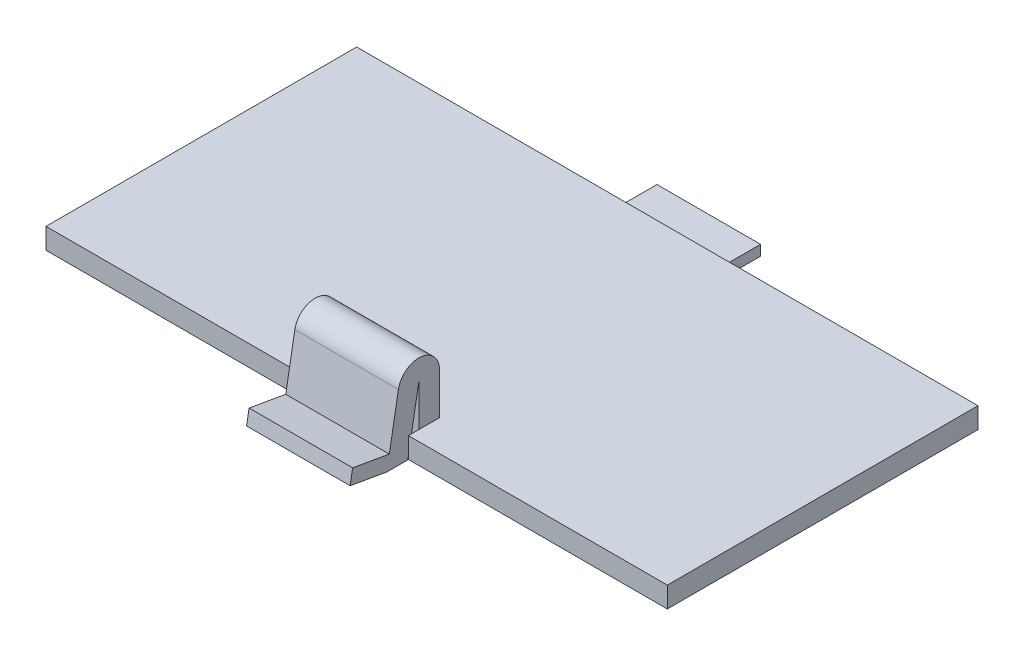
from build123d import *

# Parameters (mm, degrees)
SKETCH1_W            = 30
SKETCH1_H            = 15
BOSS_EXTRUDE1_DEPTH  = 1
SKETCH2_W            = 5
SKETCH2_H            = 0.5
BOSS_EXTRUDE4_DEPTH  = 2
SKETCH4_W            = 5
SKETCH4_H            = 1
BOSS_EXTRUDE5_DEPTH  = 2
SKETCH5_W            = 5
SKETCH5_H            = 1
REVOLVE1_ANGLE       = 170
SKETCH6_W            = 5
SKETCH6_H            = 0.5
CUT_EXTRUDE2_DEPTH   = 2
SKETCH7_W            = 5
SKETCH7_H            = 1
BOSS_EXTRUDE6_DEPTH  = 4
SKETCH8_W            = 5.3597241
SKETCH8_H            = 3.781935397
CUT_EXTRUDE3_DEPTH   = 50
SKETCH11_W           = 5
SKETCH11_H           = 0.7
BOSS_EXTRUDE12_DEPTH = 1.8


with BuildPart() as part:
    # Sketch1 → Boss-Extrude1 (new body)
    with BuildSketch(Plane(origin=(0, 0, 0), x_dir=(1, 0, 0), z_dir=(0, 1, 0))):
        with Locations((-122.755102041, -56.785714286)):
            Rectangle(SKETCH1_W, SKETCH1_H)
    extrude(amount=BOSS_EXTRUDE1_DEPTH)

    # Sketch2 → Boss-Extrude4 (add)
    with BuildSketch(Plane(origin=(0, 0, 49.285714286), x_dir=(-1, 0, 0), z_dir=(0, 0, -1))):
        with Locations((122.755102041, 0.25)):
            Rectangle(SKETCH2_W, SKETCH2_H)
    extrude(amount=BOSS_EXTRUDE4_DEPTH)

    # Sketch4 → Boss-Extrude5 (add)
    with BuildSketch(Plane(origin=(0, 1, 0), x_dir=(1, 0, 0), z_dir=(0, 1, 0))):
        with Locations((-122.755102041, -63.285714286)):
            Rectangle(SKETCH4_W, SKETCH4_H)
    extrude(amount=BOSS_EXTRUDE5_DEPTH)

    # Sketch5 → Revolve1 (revolve)
    with BuildSketch(Plane(origin=(0, 3, 0), x_dir=(1, 0, 0), z_dir=(0, 1, 0))):
        with Locations((-122.755102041, -63.285714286)):
            Rectangle(SKETCH5_W, SKETCH5_H)
    revolve(axis=Axis((-130.66128049, 3, 63.785714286), (1, 0, 0)), revolution_arc=REVOLVE1_ANGLE)

    # Sketch6 → Cut-Extrude2 (cut)
    with BuildSketch(Plane(origin=(0, 1, 0), x_dir=(1, 0, 0), z_dir=(0, 1, 0))):
        with Locations((-122.755102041, -64.035714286)):
            Rectangle(SKETCH6_W, SKETCH6_H)
    extrude(amount=-CUT_EXTRUDE2_DEPTH, mode=Mode.SUBTRACT)

    # Sketch7 → Boss-Extrude6 (add)
    with BuildSketch(Plane(origin=(0, -7.99846064, 1.410344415), x_dir=(-1, 0, 0), z_dir=(0, -0.9848077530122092, 0.17364817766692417))):
        with Locations((122.755102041, -63.837610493)):
            Rectangle(SKETCH7_W, SKETCH7_H)
    extrude(amount=BOSS_EXTRUDE6_DEPTH)

    # Sketch8 → Cut-Extrude3 (cut)
    with BuildSketch(Plane(origin=(0, 0, 47.285714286), x_dir=(-1, 0, 0), z_dir=(0, 0, -1))):
        with Locations((122.934964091, -1.890967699)):
            Rectangle(SKETCH8_W, SKETCH8_H)
    extrude(amount=-CUT_EXTRUDE3_DEPTH, mode=Mode.SUBTRACT)

    # Sketch11 → Boss-Extrude12 (add)
    with BuildSketch(Plane(origin=(0, 11.172108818, 63.360177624), x_dir=(1, 0, 0), z_dir=(0, 0.17364817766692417, 0.9848077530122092))):
        with Locations((-122.755102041, -10.994456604)):
            Rectangle(SKETCH11_W, SKETCH11_H)
    extrude(amount=BOSS_EXTRUDE12_DEPTH)


solid = part.part
